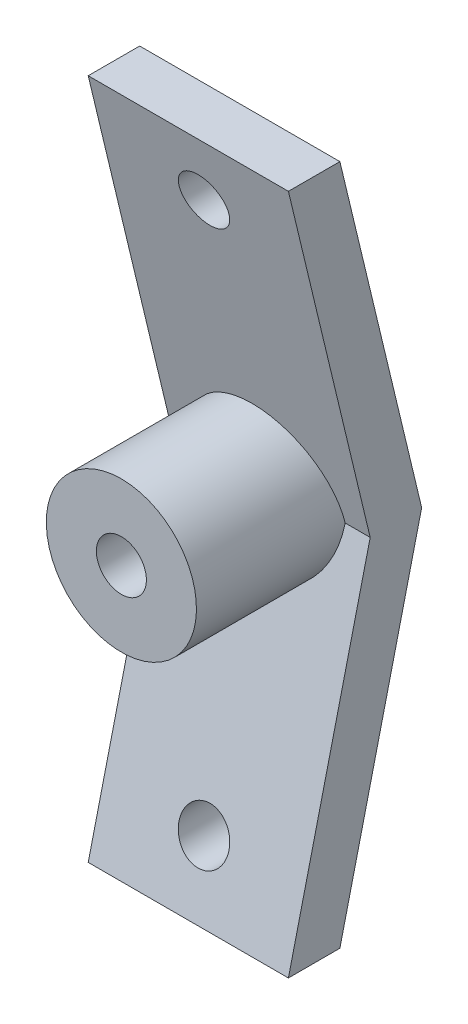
from build123d import *

# Parameters (mm, degrees)
BOSS_EXTRU_1_DEPTH      = 2
BOSS_EXTRU_1_DEPTH_BACK = 2
ESQUISSE6_R             = 0.5
ENL_V_MAT_EXTRU_1_DEPTH = 10


with BuildPart() as part:
    # Esquisse2 → R_volution1 (revolve)
    with BuildSketch(Plane(origin=(0, 0, 0), x_dir=(0, 0, -1), z_dir=(1, 0, 0))):
        Polygon((-2, 0.5), (-4, 0.5), (-4, 1.5), (-0.360118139, 1.5), (0, 0), (-2, 0), align=None)
    revolve(axis=Axis((0, 0, 0), (0, 0, 1)))


with BuildPart() as body_2:
    # Esquisse5 → Boss.-Extru.1 (new, two sides: drawn at the far end of the back side and taken through both)
    with BuildSketch(Plane(origin=(0, 0, 0), x_dir=(0, 0, -1), z_dir=(1, 0, 0)).offset(-BOSS_EXTRU_1_DEPTH_BACK)):
        Polygon((0, 0), (-1.634117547, 6.806589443), (-2.662532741, 6.806589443), (-1.028415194, 0), (-2.662532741, -6.806589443), (-1.634117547, -6.806589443), align=None)
    extrude(amount=BOSS_EXTRU_1_DEPTH + BOSS_EXTRU_1_DEPTH_BACK)

    # Esquisse6 → Enl_v. mat.-Extru.1 (cut)
    with BuildSketch(Plane.XY):
        with Locations(Location((0, 5.5, 0), (0, 0, 270))):
            Circle(ESQUISSE6_R)
        with Locations(Location((0, -5.5, 0), (0, 0, 90))):
            Circle(ESQUISSE6_R)
    extrude(amount=ENL_V_MAT_EXTRU_1_DEPTH, mode=Mode.SUBTRACT)


solid = Compound([part.part, body_2.part])
